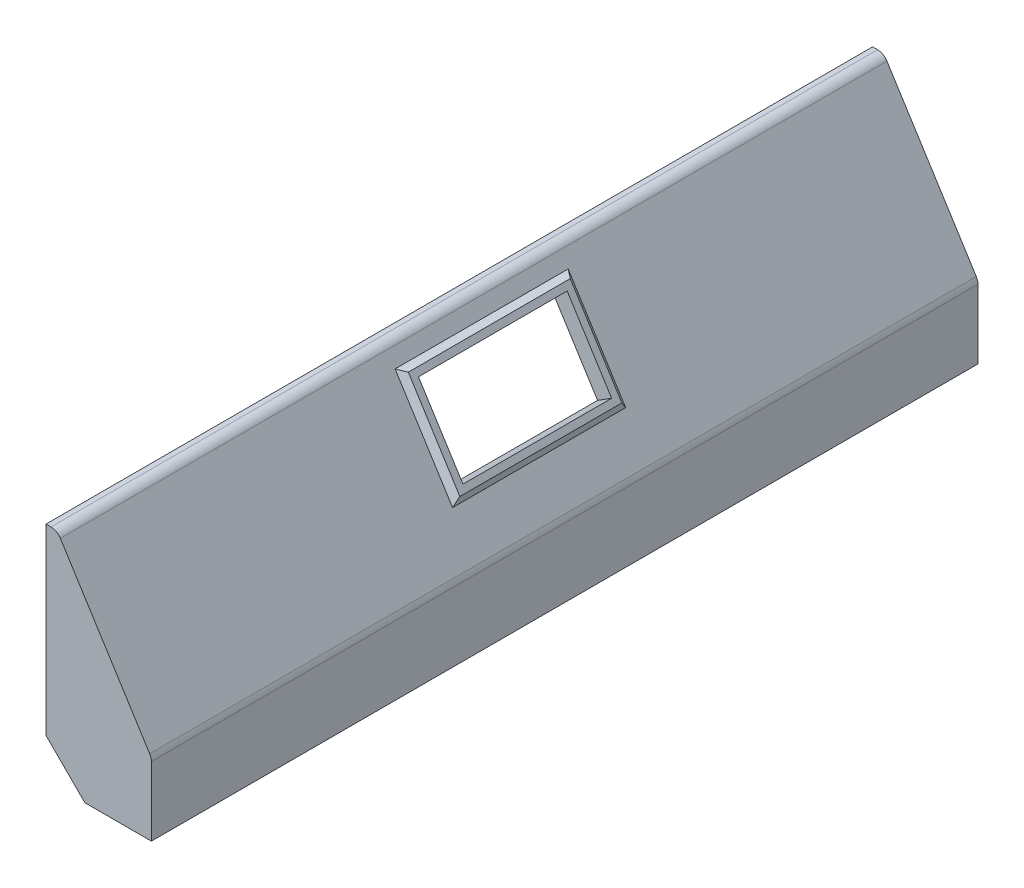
ISO-10303-21;
HEADER;
FILE_DESCRIPTION(('STEP AP214'),'2;1');
FILE_NAME('part.step','',(''),(''),'','','');
FILE_SCHEMA(('AUTOMOTIVE_DESIGN { 1 0 10303 214 1 1 1 1 }'));
ENDSEC;
DATA;
#1=APPLICATION_CONTEXT('core data for automotive mechanical design processes');
#2=APPLICATION_PROTOCOL_DEFINITION('international standard','automotive_design',2000,#1);
#3=PRODUCT_CONTEXT('',#1,'mechanical');
#4=PRODUCT('Part','Part','',(#3));
#5=PRODUCT_RELATED_PRODUCT_CATEGORY('part','',(#4));
#6=PRODUCT_DEFINITION_FORMATION('','',#4);
#7=PRODUCT_DEFINITION_CONTEXT('part definition',#1,'design');
#8=PRODUCT_DEFINITION('design','',#6,#7);
#9=PRODUCT_DEFINITION_SHAPE('','',#8);
#10=(LENGTH_UNIT() NAMED_UNIT(*) SI_UNIT(.MILLI.,.METRE.));
#11=(NAMED_UNIT(*) PLANE_ANGLE_UNIT() SI_UNIT($,.RADIAN.));
#12=(NAMED_UNIT(*) SI_UNIT($,.STERADIAN.) SOLID_ANGLE_UNIT());
#13=UNCERTAINTY_MEASURE_WITH_UNIT(LENGTH_MEASURE(1.E-05),#10,'distance_accuracy_value','');
#14=(GEOMETRIC_REPRESENTATION_CONTEXT(3) GLOBAL_UNCERTAINTY_ASSIGNED_CONTEXT((#13)) GLOBAL_UNIT_ASSIGNED_CONTEXT((#10,
#11,#12)) REPRESENTATION_CONTEXT('',''));
#15=CARTESIAN_POINT('',(0.,0.,0.));
#16=DIRECTION('',(0.,0.,1.));
#17=DIRECTION('',(1.,0.,0.));
#18=AXIS2_PLACEMENT_3D('',#15,#16,#17);
#19=CARTESIAN_POINT('',(0.,13.,-74.5));
#20=DIRECTION('',(0.846232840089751,0.532813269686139,0.));
#21=DIRECTION('',(-0.532813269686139,0.846232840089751,0.));
#22=AXIS2_PLACEMENT_3D('',#19,#20,#21);
#23=PLANE('',#22);
#24=DIRECTION('',(0.532813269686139,-0.846232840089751,0.));
#25=VECTOR('',#24,1.);
#26=CARTESIAN_POINT('',(0.,13.,-15.6));
#27=LINE('',#26,#25);
#28=CARTESIAN_POINT('',(-14.9753095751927,36.784315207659,-15.6));
#29=VERTEX_POINT('',#28);
#30=CARTESIAN_POINT('',(-4.61209147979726,20.3250864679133,-15.6));
#31=VERTEX_POINT('',#30);
#32=EDGE_CURVE('E365',#29,#31,#27,.T.);
#33=ORIENTED_EDGE('',*,*,#32,.T.);
#34=DIRECTION('',(0.,0.,1.));
#35=VECTOR('',#34,1.);
#36=CARTESIAN_POINT('',(-4.61209147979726,20.3250864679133,-74.5));
#37=LINE('',#36,#35);
#38=CARTESIAN_POINT('',(-4.61209147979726,20.3250864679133,15.6));
#39=VERTEX_POINT('',#38);
#40=EDGE_CURVE('E374',#31,#39,#37,.T.);
#41=ORIENTED_EDGE('',*,*,#40,.T.);
#42=DIRECTION('',(-0.532813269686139,0.846232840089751,0.));
#43=VECTOR('',#42,1.);
#44=CARTESIAN_POINT('',(0.,13.,15.6));
#45=LINE('',#44,#43);
#46=CARTESIAN_POINT('',(-14.9753095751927,36.784315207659,15.6));
#47=VERTEX_POINT('',#46);
#48=EDGE_CURVE('E371',#39,#47,#45,.T.);
#49=ORIENTED_EDGE('',*,*,#48,.T.);
#50=DIRECTION('',(0.,0.,-1.));
#51=VECTOR('',#50,1.);
#52=CARTESIAN_POINT('',(-14.9753095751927,36.784315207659,-74.5));
#53=LINE('',#52,#51);
#54=EDGE_CURVE('E368',#47,#29,#53,.T.);
#55=ORIENTED_EDGE('',*,*,#54,.T.);
#56=EDGE_LOOP('',(#33,#41,#49,#55));
#57=FACE_BOUND('',#56,.T.);
#58=DIRECTION('',(-0.532813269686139,0.846232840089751,0.));
#59=VECTOR('',#58,1.);
#60=CARTESIAN_POINT('',(0.,13.,74.5));
#61=LINE('',#60,#59);
#62=CARTESIAN_POINT('',(-0.307534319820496,13.4884368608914,74.5));
#63=VERTEX_POINT('',#62);
#64=CARTESIAN_POINT('',(-16.4116907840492,39.0656265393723,74.5));
#65=VERTEX_POINT('',#64);
#66=EDGE_CURVE('E313',#63,#65,#61,.T.);
#67=ORIENTED_EDGE('',*,*,#66,.F.);
#68=DIRECTION('',(0.,0.,1.));
#69=VECTOR('',#68,1.);
#70=CARTESIAN_POINT('',(-0.307534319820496,13.4884368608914,-74.5));
#71=LINE('',#70,#69);
#72=CARTESIAN_POINT('',(-0.307534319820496,13.4884368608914,-74.5));
#73=VERTEX_POINT('',#72);
#74=EDGE_CURVE('E444',#63,#73,#71,.F.);
#75=ORIENTED_EDGE('',*,*,#74,.T.);
#76=DIRECTION('',(-0.532813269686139,0.846232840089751,0.));
#77=VECTOR('',#76,1.);
#78=CARTESIAN_POINT('',(0.,13.,-74.5));
#79=LINE('',#78,#77);
#80=CARTESIAN_POINT('',(-16.4116907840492,39.0656265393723,-74.5));
#81=VERTEX_POINT('',#80);
#82=EDGE_CURVE('E331',#73,#81,#79,.T.);
#83=ORIENTED_EDGE('',*,*,#82,.T.);
#84=DIRECTION('',(0.,0.,1.));
#85=VECTOR('',#84,1.);
#86=CARTESIAN_POINT('',(-16.4116907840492,39.0656265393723,-74.5));
#87=LINE('',#86,#85);
#88=EDGE_CURVE('E440',#81,#65,#87,.T.);
#89=ORIENTED_EDGE('',*,*,#88,.T.);
#90=EDGE_LOOP('',(#67,#75,#83,#89));
#91=FACE_BOUND('',#90,.T.);
#92=ADVANCED_FACE('F44',(#57,#91),#23,.T.);
#93=CARTESIAN_POINT('',(-2.,0.,-74.5));
#94=DIRECTION('',(-1.,0.,0.));
#95=DIRECTION('',(0.,0.,1.));
#96=AXIS2_PLACEMENT_3D('',#93,#94,#95);
#97=PLANE('',#96);
#98=DIRECTION('',(0.,1.,0.));
#99=VECTOR('',#98,1.);
#100=CARTESIAN_POINT('',(-2.,12.4228103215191,-73.));
#101=LINE('',#100,#99);
#102=CARTESIAN_POINT('',(-2.,1.5,-73.));
#103=VERTEX_POINT('',#102);
#104=CARTESIAN_POINT('',(-2.,12.4228103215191,-73.));
#105=VERTEX_POINT('',#104);
#106=EDGE_CURVE('E283',#103,#105,#101,.T.);
#107=ORIENTED_EDGE('',*,*,#106,.F.);
#108=DIRECTION('',(0.,0.,1.));
#109=VECTOR('',#108,1.);
#110=CARTESIAN_POINT('',(-2.,1.5,-74.5));
#111=LINE('',#110,#109);
#112=CARTESIAN_POINT('',(-2.,1.5,73.));
#113=VERTEX_POINT('',#112);
#114=EDGE_CURVE('E267',#103,#113,#111,.T.);
#115=ORIENTED_EDGE('',*,*,#114,.T.);
#116=DIRECTION('',(0.,1.,0.));
#117=VECTOR('',#116,1.);
#118=CARTESIAN_POINT('',(-2.,12.4228103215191,73.));
#119=LINE('',#118,#117);
#120=CARTESIAN_POINT('',(-2.,12.4228103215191,73.));
#121=VERTEX_POINT('',#120);
#122=EDGE_CURVE('E303',#113,#121,#119,.T.);
#123=ORIENTED_EDGE('',*,*,#122,.T.);
#124=DIRECTION('',(0.,0.,1.));
#125=VECTOR('',#124,1.);
#126=CARTESIAN_POINT('',(-2.,12.4228103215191,-74.5));
#127=LINE('',#126,#125);
#128=EDGE_CURVE('E343',#105,#121,#127,.T.);
#129=ORIENTED_EDGE('',*,*,#128,.F.);
#130=EDGE_LOOP('',(#107,#115,#123,#129));
#131=FACE_BOUND('',#130,.T.);
#132=ADVANCED_FACE('F479',(#131),#97,.T.);
#133=CARTESIAN_POINT('',(0.,0.,-74.5));
#134=DIRECTION('',(0.,-1.,0.));
#135=DIRECTION('',(0.,0.,-1.));
#136=AXIS2_PLACEMENT_3D('',#133,#134,#135);
#137=PLANE('',#136);
#138=DIRECTION('',(1.,0.,0.));
#139=VECTOR('',#138,1.);
#140=CARTESIAN_POINT('',(-2.,0.,-73.));
#141=LINE('',#140,#139);
#142=CARTESIAN_POINT('',(-12.,0.,-73.));
#143=VERTEX_POINT('',#142);
#144=CARTESIAN_POINT('',(-4.,0.,-73.));
#145=VERTEX_POINT('',#144);
#146=EDGE_CURVE('E286',#143,#145,#141,.T.);
#147=ORIENTED_EDGE('',*,*,#146,.F.);
#148=DIRECTION('',(0.,0.,-1.));
#149=VECTOR('',#148,1.);
#150=CARTESIAN_POINT('',(-12.,0.,-74.5));
#151=LINE('',#150,#149);
#152=CARTESIAN_POINT('',(-12.,0.,-74.5));
#153=VERTEX_POINT('',#152);
#154=EDGE_CURVE('E407',#143,#153,#151,.T.);
#155=ORIENTED_EDGE('',*,*,#154,.T.);
#156=DIRECTION('',(1.,0.,0.));
#157=VECTOR('',#156,1.);
#158=CARTESIAN_POINT('',(0.,0.,-74.5));
#159=LINE('',#158,#157);
#160=CARTESIAN_POINT('',(0.,0.,-74.5));
#161=VERTEX_POINT('',#160);
#162=EDGE_CURVE('E324',#153,#161,#159,.T.);
#163=ORIENTED_EDGE('',*,*,#162,.T.);
#164=DIRECTION('',(0.,0.,1.));
#165=VECTOR('',#164,1.);
#166=CARTESIAN_POINT('',(0.,0.,-74.5));
#167=LINE('',#166,#165);
#168=CARTESIAN_POINT('',(0.,0.,74.5));
#169=VERTEX_POINT('',#168);
#170=EDGE_CURVE('E342',#161,#169,#167,.T.);
#171=ORIENTED_EDGE('',*,*,#170,.T.);
#172=DIRECTION('',(1.,0.,0.));
#173=VECTOR('',#172,1.);
#174=CARTESIAN_POINT('',(0.,0.,74.5));
#175=LINE('',#174,#173);
#176=CARTESIAN_POINT('',(-12.,0.,74.5));
#177=VERTEX_POINT('',#176);
#178=EDGE_CURVE('E306',#177,#169,#175,.T.);
#179=ORIENTED_EDGE('',*,*,#178,.F.);
#180=DIRECTION('',(0.,0.,-1.));
#181=VECTOR('',#180,1.);
#182=CARTESIAN_POINT('',(-12.,0.,-74.5));
#183=LINE('',#182,#181);
#184=CARTESIAN_POINT('',(-12.,0.,73.));
#185=VERTEX_POINT('',#184);
#186=EDGE_CURVE('E391',#177,#185,#183,.T.);
#187=ORIENTED_EDGE('',*,*,#186,.T.);
#188=DIRECTION('',(1.,0.,0.));
#189=VECTOR('',#188,1.);
#190=CARTESIAN_POINT('',(-2.,0.,73.));
#191=LINE('',#190,#189);
#192=CARTESIAN_POINT('',(-4.,0.,73.));
#193=VERTEX_POINT('',#192);
#194=EDGE_CURVE('E300',#185,#193,#191,.T.);
#195=ORIENTED_EDGE('',*,*,#194,.T.);
#196=DIRECTION('',(0.,0.,-1.));
#197=VECTOR('',#196,1.);
#198=CARTESIAN_POINT('',(-4.,0.,74.5));
#199=LINE('',#198,#197);
#200=EDGE_CURVE('E262',#193,#145,#199,.T.);
#201=ORIENTED_EDGE('',*,*,#200,.T.);
#202=EDGE_LOOP('',(#147,#155,#163,#171,#179,#187,#195,#201));
#203=FACE_BOUND('',#202,.T.);
#204=ADVANCED_FACE('F487',(#203),#137,.T.);
#205=CARTESIAN_POINT('',(-2.,12.4228103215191,-74.5));
#206=DIRECTION('',(-0.84623284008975,-0.532813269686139,0.));
#207=DIRECTION('',(0.53281326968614,-0.846232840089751,0.));
#208=AXIS2_PLACEMENT_3D('',#205,#206,#207);
#209=PLANE('',#208);
#210=DIRECTION('',(0.,0.,-1.));
#211=VECTOR('',#210,1.);
#212=CARTESIAN_POINT('',(-7.47674635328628,21.1211721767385,13.4));
#213=LINE('',#212,#211);
#214=CARTESIAN_POINT('',(-7.47674635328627,21.1211721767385,13.4));
#215=VERTEX_POINT('',#214);
#216=CARTESIAN_POINT('',(-7.47674635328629,21.1211721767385,-13.4));
#217=VERTEX_POINT('',#216);
#218=EDGE_CURVE('E242',#215,#217,#213,.T.);
#219=ORIENTED_EDGE('',*,*,#218,.T.);
#220=DIRECTION('',(-0.53281326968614,0.846232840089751,0.));
#221=VECTOR('',#220,1.);
#222=CARTESIAN_POINT('',(-15.4955860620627,33.8569764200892,-13.4));
#223=LINE('',#222,#221);
#224=CARTESIAN_POINT('',(-15.4955860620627,33.8569764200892,-13.4));
#225=VERTEX_POINT('',#224);
#226=EDGE_CURVE('E252',#217,#225,#223,.T.);
#227=ORIENTED_EDGE('',*,*,#226,.T.);
#228=DIRECTION('',(0.,0.,1.));
#229=VECTOR('',#228,1.);
#230=CARTESIAN_POINT('',(-15.4955860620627,33.8569764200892,13.4));
#231=LINE('',#230,#229);
#232=CARTESIAN_POINT('',(-15.4955860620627,33.8569764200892,13.4));
#233=VERTEX_POINT('',#232);
#234=EDGE_CURVE('E218',#225,#233,#231,.T.);
#235=ORIENTED_EDGE('',*,*,#234,.T.);
#236=DIRECTION('',(0.53281326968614,-0.846232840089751,0.));
#237=VECTOR('',#236,1.);
#238=CARTESIAN_POINT('',(-15.4955860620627,33.8569764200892,13.4));
#239=LINE('',#238,#237);
#240=EDGE_CURVE('E214',#233,#215,#239,.T.);
#241=ORIENTED_EDGE('',*,*,#240,.T.);
#242=EDGE_LOOP('',(#219,#227,#235,#241));
#243=FACE_BOUND('',#242,.T.);
#244=DIRECTION('',(-0.532813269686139,0.84623284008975,0.));
#245=VECTOR('',#244,1.);
#246=CARTESIAN_POINT('',(-18.1041564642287,38.,73.));
#247=LINE('',#246,#245);
#248=CARTESIAN_POINT('',(-17.5231892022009,37.0772872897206,73.));
#249=VERTEX_POINT('',#248);
#250=EDGE_CURVE('E293',#121,#249,#247,.T.);
#251=ORIENTED_EDGE('',*,*,#250,.T.);
#252=DIRECTION('',(0.,0.,1.));
#253=VECTOR('',#252,1.);
#254=CARTESIAN_POINT('',(-17.5231892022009,37.0772872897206,-73.));
#255=LINE('',#254,#253);
#256=CARTESIAN_POINT('',(-17.5231892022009,37.0772872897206,-73.));
#257=VERTEX_POINT('',#256);
#258=EDGE_CURVE('E60',#249,#257,#255,.F.);
#259=ORIENTED_EDGE('',*,*,#258,.T.);
#260=DIRECTION('',(-0.532813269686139,0.84623284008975,0.));
#261=VECTOR('',#260,1.);
#262=CARTESIAN_POINT('',(-18.1041564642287,38.,-73.));
#263=LINE('',#262,#261);
#264=EDGE_CURVE('E280',#105,#257,#263,.T.);
#265=ORIENTED_EDGE('',*,*,#264,.F.);
#266=ORIENTED_EDGE('',*,*,#128,.T.);
#267=EDGE_LOOP('',(#251,#259,#265,#266));
#268=FACE_BOUND('',#267,.T.);
#269=ADVANCED_FACE('F502',(#243,#268),#209,.T.);
#270=CARTESIAN_POINT('',(-19.,40.,-74.5));
#271=DIRECTION('',(-1.,0.,0.));
#272=DIRECTION('',(0.,0.,1.));
#273=AXIS2_PLACEMENT_3D('',#270,#271,#272);
#274=PLANE('',#273);
#275=DIRECTION('',(0.,-1.,0.));
#276=VECTOR('',#275,1.);
#277=CARTESIAN_POINT('',(-19.,40.,-74.5));
#278=LINE('',#277,#276);
#279=CARTESIAN_POINT('',(-19.,40.,-74.5));
#280=VERTEX_POINT('',#279);
#281=CARTESIAN_POINT('',(-19.,7.00000000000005,-74.5));
#282=VERTEX_POINT('',#281);
#283=EDGE_CURVE('E338',#280,#282,#278,.T.);
#284=ORIENTED_EDGE('',*,*,#283,.T.);
#285=DIRECTION('',(0.,0.,1.));
#286=VECTOR('',#285,1.);
#287=CARTESIAN_POINT('',(-19.,7.00000000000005,-74.5));
#288=LINE('',#287,#286);
#289=CARTESIAN_POINT('',(-19.,7.00000000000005,-73.));
#290=VERTEX_POINT('',#289);
#291=EDGE_CURVE('E418',#282,#290,#288,.T.);
#292=ORIENTED_EDGE('',*,*,#291,.T.);
#293=DIRECTION('',(0.,-1.,0.));
#294=VECTOR('',#293,1.);
#295=CARTESIAN_POINT('',(-19.,38.,-73.));
#296=LINE('',#295,#294);
#297=CARTESIAN_POINT('',(-19.,38.,-73.));
#298=VERTEX_POINT('',#297);
#299=EDGE_CURVE('E289',#298,#290,#296,.T.);
#300=ORIENTED_EDGE('',*,*,#299,.F.);
#301=DIRECTION('',(0.,0.,1.));
#302=VECTOR('',#301,1.);
#303=CARTESIAN_POINT('',(-19.,38.,-74.5));
#304=LINE('',#303,#302);
#305=CARTESIAN_POINT('',(-19.,38.,73.));
#306=VERTEX_POINT('',#305);
#307=EDGE_CURVE('E348',#298,#306,#304,.T.);
#308=ORIENTED_EDGE('',*,*,#307,.T.);
#309=DIRECTION('',(0.,-1.,0.));
#310=VECTOR('',#309,1.);
#311=CARTESIAN_POINT('',(-19.,38.,73.));
#312=LINE('',#311,#310);
#313=CARTESIAN_POINT('',(-19.,7.00000000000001,73.));
#314=VERTEX_POINT('',#313);
#315=EDGE_CURVE('E296',#306,#314,#312,.T.);
#316=ORIENTED_EDGE('',*,*,#315,.T.);
#317=DIRECTION('',(0.,0.,1.));
#318=VECTOR('',#317,1.);
#319=CARTESIAN_POINT('',(-19.,7.00000000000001,-74.5));
#320=LINE('',#319,#318);
#321=CARTESIAN_POINT('',(-19.,7.00000000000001,74.5));
#322=VERTEX_POINT('',#321);
#323=EDGE_CURVE('E414',#314,#322,#320,.T.);
#324=ORIENTED_EDGE('',*,*,#323,.T.);
#325=DIRECTION('',(0.,-1.,0.));
#326=VECTOR('',#325,1.);
#327=CARTESIAN_POINT('',(-19.,40.,74.5));
#328=LINE('',#327,#326);
#329=CARTESIAN_POINT('',(-19.,40.,74.5));
#330=VERTEX_POINT('',#329);
#331=EDGE_CURVE('E320',#330,#322,#328,.T.);
#332=ORIENTED_EDGE('',*,*,#331,.F.);
#333=DIRECTION('',(0.,0.,1.));
#334=VECTOR('',#333,1.);
#335=CARTESIAN_POINT('',(-19.,40.,-74.5));
#336=LINE('',#335,#334);
#337=EDGE_CURVE('E352',#280,#330,#336,.T.);
#338=ORIENTED_EDGE('',*,*,#337,.F.);
#339=EDGE_LOOP('',(#284,#292,#300,#308,#316,#324,#332,#338));
#340=FACE_BOUND('',#339,.T.);
#341=ADVANCED_FACE('F465',(#340),#274,.T.);
#342=CARTESIAN_POINT('',(-17.,40.,-74.5));
#343=DIRECTION('',(0.,1.,0.));
#344=DIRECTION('',(0.,0.,1.));
#345=AXIS2_PLACEMENT_3D('',#342,#343,#344);
#346=PLANE('',#345);
#347=DIRECTION('',(-1.,0.,0.));
#348=VECTOR('',#347,1.);
#349=CARTESIAN_POINT('',(-17.,40.,74.5));
#350=LINE('',#349,#348);
#351=CARTESIAN_POINT('',(-18.1041564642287,40.,74.5));
#352=VERTEX_POINT('',#351);
#353=EDGE_CURVE('E317',#352,#330,#350,.T.);
#354=ORIENTED_EDGE('',*,*,#353,.F.);
#355=DIRECTION('',(0.,0.,1.));
#356=VECTOR('',#355,1.);
#357=CARTESIAN_POINT('',(-18.1041564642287,40.,-74.5));
#358=LINE('',#357,#356);
#359=CARTESIAN_POINT('',(-18.1041564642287,40.,-74.5));
#360=VERTEX_POINT('',#359);
#361=EDGE_CURVE('E11',#352,#360,#358,.F.);
#362=ORIENTED_EDGE('',*,*,#361,.T.);
#363=DIRECTION('',(-1.,0.,0.));
#364=VECTOR('',#363,1.);
#365=CARTESIAN_POINT('',(-17.,40.,-74.5));
#366=LINE('',#365,#364);
#367=EDGE_CURVE('E335',#360,#280,#366,.T.);
#368=ORIENTED_EDGE('',*,*,#367,.T.);
#369=ORIENTED_EDGE('',*,*,#337,.T.);
#370=EDGE_LOOP('',(#354,#362,#368,#369));
#371=FACE_BOUND('',#370,.T.);
#372=ADVANCED_FACE('F493',(#371),#346,.T.);
#373=CARTESIAN_POINT('',(0.,0.,-74.5));
#374=DIRECTION('',(1.,0.,0.));
#375=DIRECTION('',(0.,1.,0.));
#376=AXIS2_PLACEMENT_3D('',#373,#374,#375);
#377=PLANE('',#376);
#378=DIRECTION('',(0.,1.,0.));
#379=VECTOR('',#378,1.);
#380=CARTESIAN_POINT('',(0.,0.,-74.5));
#381=LINE('',#380,#379);
#382=CARTESIAN_POINT('',(0.,12.4228103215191,-74.5));
#383=VERTEX_POINT('',#382);
#384=EDGE_CURVE('E327',#161,#383,#381,.T.);
#385=ORIENTED_EDGE('',*,*,#384,.T.);
#386=DIRECTION('',(0.,0.,1.));
#387=VECTOR('',#386,1.);
#388=CARTESIAN_POINT('',(0.,12.4228103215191,-74.5));
#389=LINE('',#388,#387);
#390=CARTESIAN_POINT('',(0.,12.4228103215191,74.5));
#391=VERTEX_POINT('',#390);
#392=EDGE_CURVE('E430',#383,#391,#389,.T.);
#393=ORIENTED_EDGE('',*,*,#392,.T.);
#394=DIRECTION('',(0.,1.,0.));
#395=VECTOR('',#394,1.);
#396=CARTESIAN_POINT('',(0.,0.,74.5));
#397=LINE('',#396,#395);
#398=EDGE_CURVE('E309',#169,#391,#397,.T.);
#399=ORIENTED_EDGE('',*,*,#398,.F.);
#400=ORIENTED_EDGE('',*,*,#170,.F.);
#401=EDGE_LOOP('',(#385,#393,#399,#400));
#402=FACE_BOUND('',#401,.T.);
#403=ADVANCED_FACE('F495',(#402),#377,.T.);
#404=CARTESIAN_POINT('',(0.,0.,-74.5));
#405=DIRECTION('',(0.,0.,-1.));
#406=DIRECTION('',(-1.,0.,0.));
#407=AXIS2_PLACEMENT_3D('',#404,#405,#406);
#408=PLANE('',#407);
#409=ORIENTED_EDGE('',*,*,#82,.F.);
#410=CARTESIAN_POINT('',(-2.,12.4228103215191,-74.5));
#411=DIRECTION('',(0.,0.,-1.));
#412=DIRECTION('',(-1.,0.,0.));
#413=AXIS2_PLACEMENT_3D('',#410,#411,#412);
#414=CIRCLE('',#413,2.);
#415=EDGE_CURVE('E450',#73,#383,#414,.T.);
#416=ORIENTED_EDGE('',*,*,#415,.T.);
#417=ORIENTED_EDGE('',*,*,#384,.F.);
#418=ORIENTED_EDGE('',*,*,#162,.F.);
#419=DIRECTION('',(0.707106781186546,-0.707106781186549,0.));
#420=VECTOR('',#419,1.);
#421=CARTESIAN_POINT('',(-6.00000000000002,-5.99999999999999,-74.5));
#422=LINE('',#421,#420);
#423=EDGE_CURVE('E411',#153,#282,#422,.F.);
#424=ORIENTED_EDGE('',*,*,#423,.T.);
#425=ORIENTED_EDGE('',*,*,#283,.F.);
#426=ORIENTED_EDGE('',*,*,#367,.F.);
#427=CARTESIAN_POINT('',(-18.1041564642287,38.,-74.5));
#428=DIRECTION('',(0.,0.,-1.));
#429=DIRECTION('',(-1.,0.,0.));
#430=AXIS2_PLACEMENT_3D('',#427,#428,#429);
#431=CIRCLE('',#430,2.);
#432=EDGE_CURVE('E447',#360,#81,#431,.T.);
#433=ORIENTED_EDGE('',*,*,#432,.T.);
#434=EDGE_LOOP('',(#409,#416,#417,#418,#424,#425,#426,#433));
#435=FACE_BOUND('',#434,.T.);
#436=ADVANCED_FACE('F498',(#435),#408,.T.);
#437=CARTESIAN_POINT('',(0.,0.,74.5));
#438=DIRECTION('',(0.,0.,-1.));
#439=DIRECTION('',(-1.,0.,0.));
#440=AXIS2_PLACEMENT_3D('',#437,#438,#439);
#441=PLANE('',#440);
#442=ORIENTED_EDGE('',*,*,#398,.T.);
#443=CARTESIAN_POINT('',(-2.,12.4228103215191,74.5));
#444=DIRECTION('',(0.,0.,-1.));
#445=DIRECTION('',(-1.,0.,0.));
#446=AXIS2_PLACEMENT_3D('',#443,#444,#445);
#447=CIRCLE('',#446,2.);
#448=EDGE_CURVE('E437',#391,#63,#447,.F.);
#449=ORIENTED_EDGE('',*,*,#448,.T.);
#450=ORIENTED_EDGE('',*,*,#66,.T.);
#451=CARTESIAN_POINT('',(-18.1041564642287,38.,74.5));
#452=DIRECTION('',(0.,0.,-1.));
#453=DIRECTION('',(-1.,0.,0.));
#454=AXIS2_PLACEMENT_3D('',#451,#452,#453);
#455=CIRCLE('',#454,2.);
#456=EDGE_CURVE('E434',#65,#352,#455,.F.);
#457=ORIENTED_EDGE('',*,*,#456,.T.);
#458=ORIENTED_EDGE('',*,*,#353,.T.);
#459=ORIENTED_EDGE('',*,*,#331,.T.);
#460=DIRECTION('',(-0.707106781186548,0.707106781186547,0.));
#461=VECTOR('',#460,1.);
#462=CARTESIAN_POINT('',(-19.,7.00000000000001,74.5));
#463=LINE('',#462,#461);
#464=EDGE_CURVE('E424',#322,#177,#463,.F.);
#465=ORIENTED_EDGE('',*,*,#464,.T.);
#466=ORIENTED_EDGE('',*,*,#178,.T.);
#467=EDGE_LOOP('',(#442,#449,#450,#457,#458,#459,#465,#466));
#468=FACE_BOUND('',#467,.T.);
#469=ADVANCED_FACE('F554',(#468),#441,.F.);
#470=CARTESIAN_POINT('',(0.,0.,73.));
#471=DIRECTION('',(0.,0.,-1.));
#472=DIRECTION('',(-1.,0.,0.));
#473=AXIS2_PLACEMENT_3D('',#470,#471,#472);
#474=PLANE('',#473);
#475=ORIENTED_EDGE('',*,*,#315,.F.);
#476=CARTESIAN_POINT('',(-19.2156548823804,36.0116607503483,73.));
#477=DIRECTION('',(0.,0.,-1.));
#478=DIRECTION('',(-1.,0.,0.));
#479=AXIS2_PLACEMENT_3D('',#476,#477,#478);
#480=CIRCLE('',#479,2.);
#481=EDGE_CURVE('E68',#306,#249,#480,.T.);
#482=ORIENTED_EDGE('',*,*,#481,.T.);
#483=ORIENTED_EDGE('',*,*,#250,.F.);
#484=ORIENTED_EDGE('',*,*,#122,.F.);
#485=DIRECTION('',(-1.,0.,0.));
#486=VECTOR('',#485,1.);
#487=CARTESIAN_POINT('',(0.,1.5,73.));
#488=LINE('',#487,#486);
#489=CARTESIAN_POINT('',(-4.,1.5,73.));
#490=VERTEX_POINT('',#489);
#491=EDGE_CURVE('E273',#113,#490,#488,.T.);
#492=ORIENTED_EDGE('',*,*,#491,.T.);
#493=DIRECTION('',(0.,1.,0.));
#494=VECTOR('',#493,1.);
#495=CARTESIAN_POINT('',(-4.,0.,73.));
#496=LINE('',#495,#494);
#497=EDGE_CURVE('E276',#193,#490,#496,.T.);
#498=ORIENTED_EDGE('',*,*,#497,.F.);
#499=ORIENTED_EDGE('',*,*,#194,.F.);
#500=DIRECTION('',(0.707106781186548,-0.707106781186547,0.));
#501=VECTOR('',#500,1.);
#502=CARTESIAN_POINT('',(-5.99999999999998,-5.99999999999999,73.));
#503=LINE('',#502,#501);
#504=EDGE_CURVE('E427',#185,#314,#503,.F.);
#505=ORIENTED_EDGE('',*,*,#504,.T.);
#506=EDGE_LOOP('',(#475,#482,#483,#484,#492,#498,#499,#505));
#507=FACE_BOUND('',#506,.T.);
#508=ADVANCED_FACE('F549',(#507),#474,.T.);
#509=CARTESIAN_POINT('',(0.,0.,-73.));
#510=DIRECTION('',(0.,0.,1.));
#511=DIRECTION('',(-1.,0.,0.));
#512=AXIS2_PLACEMENT_3D('',#509,#510,#511);
#513=PLANE('',#512);
#514=ORIENTED_EDGE('',*,*,#264,.T.);
#515=CARTESIAN_POINT('',(-19.2156548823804,36.0116607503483,-73.));
#516=DIRECTION('',(0.,0.,1.));
#517=DIRECTION('',(1.,0.,0.));
#518=AXIS2_PLACEMENT_3D('',#515,#516,#517);
#519=CIRCLE('',#518,2.);
#520=EDGE_CURVE('E53',#257,#298,#519,.T.);
#521=ORIENTED_EDGE('',*,*,#520,.T.);
#522=ORIENTED_EDGE('',*,*,#299,.T.);
#523=DIRECTION('',(-0.707106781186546,0.707106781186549,0.));
#524=VECTOR('',#523,1.);
#525=CARTESIAN_POINT('',(-6.00000000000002,-5.99999999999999,-73.));
#526=LINE('',#525,#524);
#527=EDGE_CURVE('E421',#290,#143,#526,.F.);
#528=ORIENTED_EDGE('',*,*,#527,.T.);
#529=ORIENTED_EDGE('',*,*,#146,.T.);
#530=DIRECTION('',(0.,-1.,0.));
#531=VECTOR('',#530,1.);
#532=CARTESIAN_POINT('',(-4.,0.,-73.));
#533=LINE('',#532,#531);
#534=CARTESIAN_POINT('',(-4.,1.5,-73.));
#535=VERTEX_POINT('',#534);
#536=EDGE_CURVE('E361',#535,#145,#533,.T.);
#537=ORIENTED_EDGE('',*,*,#536,.F.);
#538=DIRECTION('',(1.,0.,0.));
#539=VECTOR('',#538,1.);
#540=CARTESIAN_POINT('',(0.,1.5,-73.));
#541=LINE('',#540,#539);
#542=EDGE_CURVE('E347',#535,#103,#541,.T.);
#543=ORIENTED_EDGE('',*,*,#542,.T.);
#544=ORIENTED_EDGE('',*,*,#106,.T.);
#545=EDGE_LOOP('',(#514,#521,#522,#528,#529,#537,#543,#544));
#546=FACE_BOUND('',#545,.T.);
#547=ADVANCED_FACE('F460',(#546),#513,.T.);
#548=CARTESIAN_POINT('',(-4.,1.5,74.5));
#549=DIRECTION('',(-1.,0.,0.));
#550=DIRECTION('',(0.,0.,1.));
#551=AXIS2_PLACEMENT_3D('',#548,#549,#550);
#552=PLANE('',#551);
#553=ORIENTED_EDGE('',*,*,#200,.F.);
#554=ORIENTED_EDGE('',*,*,#497,.T.);
#555=DIRECTION('',(0.,0.,-1.));
#556=VECTOR('',#555,1.);
#557=CARTESIAN_POINT('',(-4.,1.5,74.5));
#558=LINE('',#557,#556);
#559=EDGE_CURVE('E263',#490,#535,#558,.T.);
#560=ORIENTED_EDGE('',*,*,#559,.T.);
#561=ORIENTED_EDGE('',*,*,#536,.T.);
#562=EDGE_LOOP('',(#553,#554,#560,#561));
#563=FACE_BOUND('',#562,.T.);
#564=ADVANCED_FACE('F572',(#563),#552,.T.);
#565=CARTESIAN_POINT('',(0.,1.5,0.));
#566=DIRECTION('',(0.,-1.,0.));
#567=DIRECTION('',(0.,0.,-1.));
#568=AXIS2_PLACEMENT_3D('',#565,#566,#567);
#569=PLANE('',#568);
#570=ORIENTED_EDGE('',*,*,#491,.F.);
#571=ORIENTED_EDGE('',*,*,#114,.F.);
#572=ORIENTED_EDGE('',*,*,#542,.F.);
#573=ORIENTED_EDGE('',*,*,#559,.F.);
#574=EDGE_LOOP('',(#570,#571,#572,#573));
#575=FACE_BOUND('',#574,.T.);
#576=ADVANCED_FACE('F576',(#575),#569,.F.);
#577=CARTESIAN_POINT('',(-33.4871206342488,4.74426985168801,13.4));
#578=DIRECTION('',(0.532813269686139,-0.84623284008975,0.));
#579=DIRECTION('',(0.846232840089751,0.532813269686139,0.));
#580=AXIS2_PLACEMENT_3D('',#577,#578,#579);
#581=PLANE('',#580);
#582=DIRECTION('',(0.84623284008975,0.532813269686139,0.));
#583=VECTOR('',#582,1.);
#584=CARTESIAN_POINT('',(-33.4871206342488,4.74426985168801,13.4));
#585=LINE('',#584,#583);
#586=CARTESIAN_POINT('',(-4.93804783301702,22.7196119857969,13.4));
#587=VERTEX_POINT('',#586);
#588=EDGE_CURVE('E249',#215,#587,#585,.T.);
#589=ORIENTED_EDGE('',*,*,#588,.T.);
#590=DIRECTION('',(0.,0.,-1.));
#591=VECTOR('',#590,1.);
#592=CARTESIAN_POINT('',(-4.93804783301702,22.7196119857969,13.4));
#593=LINE('',#592,#591);
#594=CARTESIAN_POINT('',(-4.93804783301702,22.7196119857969,-13.4));
#595=VERTEX_POINT('',#594);
#596=EDGE_CURVE('E233',#587,#595,#593,.T.);
#597=ORIENTED_EDGE('',*,*,#596,.T.);
#598=DIRECTION('',(0.84623284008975,0.532813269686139,0.));
#599=VECTOR('',#598,1.);
#600=CARTESIAN_POINT('',(-33.4871206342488,4.74426985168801,-13.4));
#601=LINE('',#600,#599);
#602=EDGE_CURVE('E246',#217,#595,#601,.T.);
#603=ORIENTED_EDGE('',*,*,#602,.F.);
#604=ORIENTED_EDGE('',*,*,#218,.F.);
#605=EDGE_LOOP('',(#589,#597,#603,#604));
#606=FACE_BOUND('',#605,.T.);
#607=ADVANCED_FACE('F599',(#606),#581,.F.);
#608=CARTESIAN_POINT('',(-41.5059603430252,17.4800740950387,-13.4));
#609=DIRECTION('',(0.,0.,-1.));
#610=DIRECTION('',(0.,1.,0.));
#611=AXIS2_PLACEMENT_3D('',#608,#609,#610);
#612=PLANE('',#611);
#613=ORIENTED_EDGE('',*,*,#602,.T.);
#614=DIRECTION('',(-0.53281326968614,0.846232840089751,0.));
#615=VECTOR('',#614,1.);
#616=CARTESIAN_POINT('',(-12.9568875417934,35.4554162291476,-13.4));
#617=LINE('',#616,#615);
#618=CARTESIAN_POINT('',(-12.9568875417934,35.4554162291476,-13.4));
#619=VERTEX_POINT('',#618);
#620=EDGE_CURVE('E237',#595,#619,#617,.T.);
#621=ORIENTED_EDGE('',*,*,#620,.T.);
#622=DIRECTION('',(0.84623284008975,0.532813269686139,0.));
#623=VECTOR('',#622,1.);
#624=CARTESIAN_POINT('',(-41.5059603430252,17.4800740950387,-13.4));
#625=LINE('',#624,#623);
#626=EDGE_CURVE('E224',#225,#619,#625,.T.);
#627=ORIENTED_EDGE('',*,*,#626,.F.);
#628=ORIENTED_EDGE('',*,*,#226,.F.);
#629=EDGE_LOOP('',(#613,#621,#627,#628));
#630=FACE_BOUND('',#629,.T.);
#631=ADVANCED_FACE('F602',(#630),#612,.F.);
#632=CARTESIAN_POINT('',(-41.5059603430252,17.4800740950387,13.4));
#633=DIRECTION('',(-0.532813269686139,0.84623284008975,0.));
#634=DIRECTION('',(-0.846232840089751,-0.532813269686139,0.));
#635=AXIS2_PLACEMENT_3D('',#632,#633,#634);
#636=PLANE('',#635);
#637=ORIENTED_EDGE('',*,*,#626,.T.);
#638=DIRECTION('',(0.,0.,1.));
#639=VECTOR('',#638,1.);
#640=CARTESIAN_POINT('',(-12.9568875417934,35.4554162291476,13.4));
#641=LINE('',#640,#639);
#642=CARTESIAN_POINT('',(-12.9568875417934,35.4554162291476,13.4));
#643=VERTEX_POINT('',#642);
#644=EDGE_CURVE('E221',#619,#643,#641,.T.);
#645=ORIENTED_EDGE('',*,*,#644,.T.);
#646=DIRECTION('',(0.84623284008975,0.532813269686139,0.));
#647=VECTOR('',#646,1.);
#648=CARTESIAN_POINT('',(-41.5059603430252,17.4800740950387,13.4));
#649=LINE('',#648,#647);
#650=EDGE_CURVE('E207',#233,#643,#649,.T.);
#651=ORIENTED_EDGE('',*,*,#650,.F.);
#652=ORIENTED_EDGE('',*,*,#234,.F.);
#653=EDGE_LOOP('',(#637,#645,#651,#652));
#654=FACE_BOUND('',#653,.T.);
#655=ADVANCED_FACE('F222',(#654),#636,.F.);
#656=CARTESIAN_POINT('',(-41.5059603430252,17.4800740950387,13.4));
#657=DIRECTION('',(0.,0.,1.));
#658=DIRECTION('',(0.,-1.,0.));
#659=AXIS2_PLACEMENT_3D('',#656,#657,#658);
#660=PLANE('',#659);
#661=ORIENTED_EDGE('',*,*,#650,.T.);
#662=DIRECTION('',(0.53281326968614,-0.846232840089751,0.));
#663=VECTOR('',#662,1.);
#664=CARTESIAN_POINT('',(-12.9568875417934,35.4554162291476,13.4));
#665=LINE('',#664,#663);
#666=EDGE_CURVE('E211',#643,#587,#665,.T.);
#667=ORIENTED_EDGE('',*,*,#666,.T.);
#668=ORIENTED_EDGE('',*,*,#588,.F.);
#669=ORIENTED_EDGE('',*,*,#240,.F.);
#670=EDGE_LOOP('',(#661,#667,#668,#669));
#671=FACE_BOUND('',#670,.T.);
#672=ADVANCED_FACE('F209',(#671),#660,.F.);
#673=CARTESIAN_POINT('',(6.70772596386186,4.2233830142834,0.));
#674=DIRECTION('',(0.846232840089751,0.53281326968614,0.));
#675=DIRECTION('',(-0.53281326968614,0.846232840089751,0.));
#676=AXIS2_PLACEMENT_3D('',#673,#674,#675);
#677=PLANE('',#676);
#678=DIRECTION('',(0.,0.,-1.));
#679=VECTOR('',#678,1.);
#680=CARTESIAN_POINT('',(-4.29867190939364,21.7041325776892,14.1));
#681=LINE('',#680,#679);
#682=CARTESIAN_POINT('',(-4.29867190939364,21.7041325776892,14.6));
#683=VERTEX_POINT('',#682);
#684=CARTESIAN_POINT('',(-4.29867190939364,21.7041325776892,-14.6));
#685=VERTEX_POINT('',#684);
#686=EDGE_CURVE('E378',#683,#685,#681,.T.);
#687=ORIENTED_EDGE('',*,*,#686,.T.);
#688=DIRECTION('',(-0.532813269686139,0.846232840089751,0.));
#689=VECTOR('',#688,1.);
#690=CARTESIAN_POINT('',(-13.3298568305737,36.0477792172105,-14.6));
#691=LINE('',#690,#689);
#692=CARTESIAN_POINT('',(-13.5962634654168,36.4708956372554,-14.6));
#693=VERTEX_POINT('',#692);
#694=EDGE_CURVE('E388',#685,#693,#691,.T.);
#695=ORIENTED_EDGE('',*,*,#694,.T.);
#696=DIRECTION('',(0.,0.,1.));
#697=VECTOR('',#696,1.);
#698=CARTESIAN_POINT('',(-13.5962634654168,36.4708956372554,14.1));
#699=LINE('',#698,#697);
#700=CARTESIAN_POINT('',(-13.5962634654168,36.4708956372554,14.6));
#701=VERTEX_POINT('',#700);
#702=EDGE_CURVE('E385',#693,#701,#699,.T.);
#703=ORIENTED_EDGE('',*,*,#702,.T.);
#704=DIRECTION('',(0.532813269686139,-0.846232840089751,0.));
#705=VECTOR('',#704,1.);
#706=CARTESIAN_POINT('',(-13.3298568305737,36.0477792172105,14.6));
#707=LINE('',#706,#705);
#708=EDGE_CURVE('E382',#701,#683,#707,.T.);
#709=ORIENTED_EDGE('',*,*,#708,.T.);
#710=EDGE_LOOP('',(#687,#695,#703,#709));
#711=FACE_BOUND('',#710,.T.);
#712=ORIENTED_EDGE('',*,*,#666,.F.);
#713=ORIENTED_EDGE('',*,*,#644,.F.);
#714=ORIENTED_EDGE('',*,*,#620,.F.);
#715=ORIENTED_EDGE('',*,*,#596,.F.);
#716=EDGE_LOOP('',(#712,#713,#714,#715));
#717=FACE_BOUND('',#716,.T.);
#718=ADVANCED_FACE('F231',(#711,#717),#677,.T.);
#719=CARTESIAN_POINT('',(-12.9067404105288,36.3141858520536,14.1));
#720=DIRECTION('',(-0.221621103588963,-0.975132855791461,0.));
#721=DIRECTION('',(0.,0.,1.));
#722=AXIS2_PLACEMENT_3D('',#719,#720,#721);
#723=PLANE('',#722);
#724=DIRECTION('',(-0.796192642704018,0.180952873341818,-0.577350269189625));
#725=VECTOR('',#724,1.);
#726=CARTESIAN_POINT('',(0.0562930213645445,33.3680418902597,-4.70000000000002));
#727=LINE('',#726,#725);
#728=EDGE_CURVE('E398',#29,#693,#727,.F.);
#729=ORIENTED_EDGE('',*,*,#728,.F.);
#730=ORIENTED_EDGE('',*,*,#54,.F.);
#731=DIRECTION('',(-0.796192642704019,0.180952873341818,0.577350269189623));
#732=VECTOR('',#731,1.);
#733=CARTESIAN_POINT('',(-12.9067404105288,36.3141858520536,14.1));
#734=LINE('',#733,#732);
#735=EDGE_CURVE('E229',#701,#47,#734,.T.);
#736=ORIENTED_EDGE('',*,*,#735,.F.);
#737=ORIENTED_EDGE('',*,*,#702,.F.);
#738=EDGE_LOOP('',(#729,#730,#736,#737));
#739=FACE_BOUND('',#738,.T.);
#740=ADVANCED_FACE('F527',(#739),#723,.F.);
#741=CARTESIAN_POINT('',(-12.9067404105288,36.3141858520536,14.1));
#742=DIRECTION('',(-0.59837697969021,-0.376755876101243,-0.707106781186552));
#743=DIRECTION('',(0.532813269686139,-0.846232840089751,0.));
#744=AXIS2_PLACEMENT_3D('',#741,#742,#743);
#745=PLANE('',#744);
#746=ORIENTED_EDGE('',*,*,#735,.T.);
#747=ORIENTED_EDGE('',*,*,#48,.F.);
#748=DIRECTION('',(-0.180952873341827,-0.796192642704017,0.577350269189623));
#749=VECTOR('',#748,1.);
#750=CARTESIAN_POINT('',(-4.14196212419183,22.3936556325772,14.1));
#751=LINE('',#750,#749);
#752=EDGE_CURVE('E395',#683,#39,#751,.T.);
#753=ORIENTED_EDGE('',*,*,#752,.F.);
#754=ORIENTED_EDGE('',*,*,#708,.F.);
#755=EDGE_LOOP('',(#746,#747,#753,#754));
#756=FACE_BOUND('',#755,.T.);
#757=ADVANCED_FACE('F520',(#756),#745,.F.);
#758=CARTESIAN_POINT('',(-12.9067404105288,36.3141858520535,-14.1));
#759=DIRECTION('',(-0.598376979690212,-0.376755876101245,0.70710678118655));
#760=DIRECTION('',(-0.532813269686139,0.846232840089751,0.));
#761=AXIS2_PLACEMENT_3D('',#758,#759,#760);
#762=PLANE('',#761);
#763=ORIENTED_EDGE('',*,*,#728,.T.);
#764=ORIENTED_EDGE('',*,*,#694,.F.);
#765=DIRECTION('',(0.180952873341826,0.796192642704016,0.577350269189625));
#766=VECTOR('',#765,1.);
#767=CARTESIAN_POINT('',(-1.19581816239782,35.3566890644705,-4.70000000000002));
#768=LINE('',#767,#766);
#769=EDGE_CURVE('E392',#31,#685,#768,.T.);
#770=ORIENTED_EDGE('',*,*,#769,.F.);
#771=ORIENTED_EDGE('',*,*,#32,.F.);
#772=EDGE_LOOP('',(#763,#764,#770,#771));
#773=FACE_BOUND('',#772,.T.);
#774=ADVANCED_FACE('F513',(#773),#762,.F.);
#775=CARTESIAN_POINT('',(-4.14196212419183,22.3936556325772,14.1));
#776=DIRECTION('',(-0.975132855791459,0.221621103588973,0.));
#777=DIRECTION('',(0.,0.,-1.));
#778=AXIS2_PLACEMENT_3D('',#775,#776,#777);
#779=PLANE('',#778);
#780=ORIENTED_EDGE('',*,*,#752,.T.);
#781=ORIENTED_EDGE('',*,*,#40,.F.);
#782=ORIENTED_EDGE('',*,*,#769,.T.);
#783=ORIENTED_EDGE('',*,*,#686,.F.);
#784=EDGE_LOOP('',(#780,#781,#782,#783));
#785=FACE_BOUND('',#784,.T.);
#786=ADVANCED_FACE('F505',(#785),#779,.F.);
#787=CARTESIAN_POINT('',(-12.,0.,-74.5));
#788=DIRECTION('',(0.707106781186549,0.707106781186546,0.));
#789=DIRECTION('',(0.,0.,-1.));
#790=AXIS2_PLACEMENT_3D('',#787,#788,#789);
#791=PLANE('',#790);
#792=ORIENTED_EDGE('',*,*,#527,.F.);
#793=ORIENTED_EDGE('',*,*,#291,.F.);
#794=ORIENTED_EDGE('',*,*,#423,.F.);
#795=ORIENTED_EDGE('',*,*,#154,.F.);
#796=EDGE_LOOP('',(#792,#793,#794,#795));
#797=FACE_BOUND('',#796,.T.);
#798=ADVANCED_FACE('F512',(#797),#791,.F.);
#799=CARTESIAN_POINT('',(-19.,7.00000000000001,-74.5));
#800=DIRECTION('',(0.707106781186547,0.707106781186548,0.));
#801=DIRECTION('',(0.,0.,1.));
#802=AXIS2_PLACEMENT_3D('',#799,#800,#801);
#803=PLANE('',#802);
#804=ORIENTED_EDGE('',*,*,#504,.F.);
#805=ORIENTED_EDGE('',*,*,#186,.F.);
#806=ORIENTED_EDGE('',*,*,#464,.F.);
#807=ORIENTED_EDGE('',*,*,#323,.F.);
#808=EDGE_LOOP('',(#804,#805,#806,#807));
#809=FACE_BOUND('',#808,.T.);
#810=ADVANCED_FACE('F475',(#809),#803,.F.);
#811=CARTESIAN_POINT('',(-2.,12.4228103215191,-74.5));
#812=DIRECTION('',(0.,0.,1.));
#813=DIRECTION('',(1.,0.,0.));
#814=AXIS2_PLACEMENT_3D('',#811,#812,#813);
#815=CYLINDRICAL_SURFACE('',#814,2.);
#816=ORIENTED_EDGE('',*,*,#415,.F.);
#817=ORIENTED_EDGE('',*,*,#74,.F.);
#818=ORIENTED_EDGE('',*,*,#448,.F.);
#819=ORIENTED_EDGE('',*,*,#392,.F.);
#820=EDGE_LOOP('',(#816,#817,#818,#819));
#821=FACE_BOUND('',#820,.T.);
#822=ADVANCED_FACE('F469',(#821),#815,.T.);
#823=CARTESIAN_POINT('',(-19.2156548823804,36.0116607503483,-74.5));
#824=DIRECTION('',(0.,0.,-1.));
#825=DIRECTION('',(-1.,0.,0.));
#826=AXIS2_PLACEMENT_3D('',#823,#824,#825);
#827=CYLINDRICAL_SURFACE('',#826,2.);
#828=ORIENTED_EDGE('',*,*,#520,.F.);
#829=ORIENTED_EDGE('',*,*,#258,.F.);
#830=ORIENTED_EDGE('',*,*,#481,.F.);
#831=ORIENTED_EDGE('',*,*,#307,.F.);
#832=EDGE_LOOP('',(#828,#829,#830,#831));
#833=FACE_BOUND('',#832,.T.);
#834=ADVANCED_FACE('F467',(#833),#827,.F.);
#835=CARTESIAN_POINT('',(-18.1041564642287,38.,-74.5));
#836=DIRECTION('',(0.,0.,1.));
#837=DIRECTION('',(1.,0.,0.));
#838=AXIS2_PLACEMENT_3D('',#835,#836,#837);
#839=CYLINDRICAL_SURFACE('',#838,2.);
#840=ORIENTED_EDGE('',*,*,#432,.F.);
#841=ORIENTED_EDGE('',*,*,#361,.F.);
#842=ORIENTED_EDGE('',*,*,#456,.F.);
#843=ORIENTED_EDGE('',*,*,#88,.F.);
#844=EDGE_LOOP('',(#840,#841,#842,#843));
#845=FACE_BOUND('',#844,.T.);
#846=ADVANCED_FACE('F46',(#845),#839,.T.);
#847=CLOSED_SHELL('',(#92,#132,#204,#269,#341,#372,#403,#436,#469,#508,#547,#564,#576,#607,#631,
#655,#672,#718,#740,#757,#774,#786,#798,#810,#822,#834,#846));
#848=MANIFOLD_SOLID_BREP('B2',#847);
#849=ADVANCED_BREP_SHAPE_REPRESENTATION('',(#18,#848),#14);
#850=SHAPE_DEFINITION_REPRESENTATION(#9,#849);
ENDSEC;
END-ISO-10303-21;
